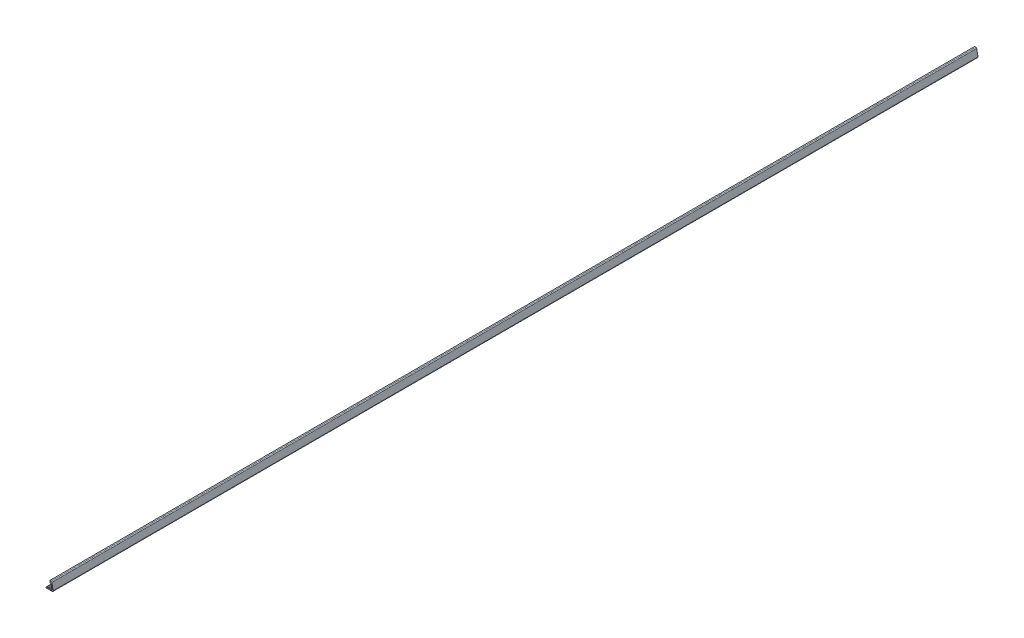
ISO-10303-21;
HEADER;
FILE_DESCRIPTION(('STEP AP214'),'2;1');
FILE_NAME('part.step','',(''),(''),'','','');
FILE_SCHEMA(('AUTOMOTIVE_DESIGN { 1 0 10303 214 1 1 1 1 }'));
ENDSEC;
DATA;
#1=APPLICATION_CONTEXT('core data for automotive mechanical design processes');
#2=APPLICATION_PROTOCOL_DEFINITION('international standard','automotive_design',2000,#1);
#3=PRODUCT_CONTEXT('',#1,'mechanical');
#4=PRODUCT('Part','Part','',(#3));
#5=PRODUCT_RELATED_PRODUCT_CATEGORY('part','',(#4));
#6=PRODUCT_DEFINITION_FORMATION('','',#4);
#7=PRODUCT_DEFINITION_CONTEXT('part definition',#1,'design');
#8=PRODUCT_DEFINITION('design','',#6,#7);
#9=PRODUCT_DEFINITION_SHAPE('','',#8);
#10=(LENGTH_UNIT() NAMED_UNIT(*) SI_UNIT(.MILLI.,.METRE.));
#11=(NAMED_UNIT(*) PLANE_ANGLE_UNIT() SI_UNIT($,.RADIAN.));
#12=(NAMED_UNIT(*) SI_UNIT($,.STERADIAN.) SOLID_ANGLE_UNIT());
#13=UNCERTAINTY_MEASURE_WITH_UNIT(LENGTH_MEASURE(1.E-05),#10,'distance_accuracy_value','');
#14=(GEOMETRIC_REPRESENTATION_CONTEXT(3) GLOBAL_UNCERTAINTY_ASSIGNED_CONTEXT((#13)) GLOBAL_UNIT_ASSIGNED_CONTEXT((#10,
#11,#12)) REPRESENTATION_CONTEXT('',''));
#15=CARTESIAN_POINT('',(0.,0.,0.));
#16=DIRECTION('',(0.,0.,1.));
#17=DIRECTION('',(1.,0.,0.));
#18=AXIS2_PLACEMENT_3D('',#15,#16,#17);
#19=CARTESIAN_POINT('',(3.10580902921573,1.,1000.));
#20=DIRECTION('',(0.,0.,-1.));
#21=DIRECTION('',(-1.,0.,0.));
#22=AXIS2_PLACEMENT_3D('',#19,#20,#21);
#23=CYLINDRICAL_SURFACE('',#22,1.);
#24=CARTESIAN_POINT('',(3.10580902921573,1.,0.));
#25=DIRECTION('',(0.,0.,1.));
#26=DIRECTION('',(1.,0.,0.));
#27=AXIS2_PLACEMENT_3D('',#24,#25,#26);
#28=CIRCLE('',#27,1.);
#29=CARTESIAN_POINT('',(3.10580902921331,0.,0.));
#30=VERTEX_POINT('',#29);
#31=CARTESIAN_POINT('',(4.08782513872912,1.18879714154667,0.));
#32=VERTEX_POINT('',#31);
#33=EDGE_CURVE('E227',#30,#32,#28,.T.);
#34=ORIENTED_EDGE('',*,*,#33,.T.);
#35=DIRECTION('',(0.,0.,-1.));
#36=VECTOR('',#35,1.);
#37=CARTESIAN_POINT('',(4.08782513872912,1.18879714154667,1000.));
#38=LINE('',#37,#36);
#39=CARTESIAN_POINT('',(4.08782513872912,1.18879714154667,1000.));
#40=VERTEX_POINT('',#39);
#41=EDGE_CURVE('E11',#40,#32,#38,.T.);
#42=ORIENTED_EDGE('',*,*,#41,.F.);
#43=CARTESIAN_POINT('',(3.10580902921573,1.,1000.));
#44=DIRECTION('',(0.,0.,1.));
#45=DIRECTION('',(1.,0.,0.));
#46=AXIS2_PLACEMENT_3D('',#43,#44,#45);
#47=CIRCLE('',#46,1.);
#48=CARTESIAN_POINT('',(3.10580902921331,0.,1000.));
#49=VERTEX_POINT('',#48);
#50=EDGE_CURVE('E273',#49,#40,#47,.T.);
#51=ORIENTED_EDGE('',*,*,#50,.F.);
#52=DIRECTION('',(0.,0.,-1.));
#53=VECTOR('',#52,1.);
#54=CARTESIAN_POINT('',(3.10580902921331,0.,1000.));
#55=LINE('',#54,#53);
#56=EDGE_CURVE('E223',#49,#30,#55,.T.);
#57=ORIENTED_EDGE('',*,*,#56,.T.);
#58=EDGE_LOOP('',(#34,#42,#51,#57));
#59=FACE_BOUND('',#58,.T.);
#60=ADVANCED_FACE('F35',(#59),#23,.T.);
#61=CARTESIAN_POINT('',(4.08782513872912,1.18879714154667,1000.));
#62=DIRECTION('',(-0.982016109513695,-0.188797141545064,0.));
#63=DIRECTION('',(0.188797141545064,-0.982016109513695,0.));
#64=AXIS2_PLACEMENT_3D('',#61,#62,#63);
#65=PLANE('',#64);
#66=DIRECTION('',(-0.188797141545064,0.982016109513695,0.));
#67=VECTOR('',#66,1.);
#68=CARTESIAN_POINT('',(4.08782513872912,1.18879714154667,0.));
#69=LINE('',#68,#67);
#70=CARTESIAN_POINT('',(2.7420427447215,8.18879714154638,0.));
#71=VERTEX_POINT('',#70);
#72=EDGE_CURVE('E230',#32,#71,#69,.T.);
#73=ORIENTED_EDGE('',*,*,#72,.T.);
#74=DIRECTION('',(0.,0.,-1.));
#75=VECTOR('',#74,1.);
#76=CARTESIAN_POINT('',(2.7420427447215,8.18879714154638,1000.));
#77=LINE('',#76,#75);
#78=CARTESIAN_POINT('',(2.7420427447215,8.18879714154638,1000.));
#79=VERTEX_POINT('',#78);
#80=EDGE_CURVE('E43',#79,#71,#77,.T.);
#81=ORIENTED_EDGE('',*,*,#80,.F.);
#82=DIRECTION('',(-0.188797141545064,0.982016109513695,0.));
#83=VECTOR('',#82,1.);
#84=CARTESIAN_POINT('',(4.08782513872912,1.18879714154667,1000.));
#85=LINE('',#84,#83);
#86=EDGE_CURVE('E142',#40,#79,#85,.T.);
#87=ORIENTED_EDGE('',*,*,#86,.F.);
#88=ORIENTED_EDGE('',*,*,#41,.T.);
#89=EDGE_LOOP('',(#73,#81,#87,#88));
#90=FACE_BOUND('',#89,.T.);
#91=ADVANCED_FACE('F411',(#90),#65,.F.);
#92=CARTESIAN_POINT('',(1.76002663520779,8.00000000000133,1000.));
#93=DIRECTION('',(0.,0.,-1.));
#94=DIRECTION('',(-1.,0.,0.));
#95=AXIS2_PLACEMENT_3D('',#92,#93,#94);
#96=CYLINDRICAL_SURFACE('',#95,1.00000000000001);
#97=CARTESIAN_POINT('',(1.76002663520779,8.00000000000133,0.));
#98=DIRECTION('',(0.,0.,1.));
#99=DIRECTION('',(1.,0.,0.));
#100=AXIS2_PLACEMENT_3D('',#97,#98,#99);
#101=CIRCLE('',#100,1.00000000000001);
#102=CARTESIAN_POINT('',(1.76002663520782,9.00000000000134,0.));
#103=VERTEX_POINT('',#102);
#104=EDGE_CURVE('E232',#71,#103,#101,.T.);
#105=ORIENTED_EDGE('',*,*,#104,.T.);
#106=DIRECTION('',(0.,0.,-1.));
#107=VECTOR('',#106,1.);
#108=CARTESIAN_POINT('',(1.76002663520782,9.00000000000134,1000.));
#109=LINE('',#108,#107);
#110=CARTESIAN_POINT('',(1.76002663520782,9.00000000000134,1000.));
#111=VERTEX_POINT('',#110);
#112=EDGE_CURVE('E328',#111,#103,#109,.T.);
#113=ORIENTED_EDGE('',*,*,#112,.F.);
#114=CARTESIAN_POINT('',(1.76002663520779,8.00000000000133,1000.));
#115=DIRECTION('',(0.,0.,1.));
#116=DIRECTION('',(1.,0.,0.));
#117=AXIS2_PLACEMENT_3D('',#114,#115,#116);
#118=CIRCLE('',#117,1.00000000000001);
#119=EDGE_CURVE('E336',#79,#111,#118,.T.);
#120=ORIENTED_EDGE('',*,*,#119,.F.);
#121=ORIENTED_EDGE('',*,*,#80,.T.);
#122=EDGE_LOOP('',(#105,#113,#120,#121));
#123=FACE_BOUND('',#122,.T.);
#124=ADVANCED_FACE('F334',(#123),#96,.T.);
#125=CARTESIAN_POINT('',(1.76002663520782,9.00000000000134,1000.));
#126=DIRECTION('',(0.,-1.,0.));
#127=DIRECTION('',(0.,0.,-1.));
#128=AXIS2_PLACEMENT_3D('',#125,#126,#127);
#129=PLANE('',#128);
#130=DIRECTION('',(-1.,0.,0.));
#131=VECTOR('',#130,1.);
#132=CARTESIAN_POINT('',(1.76002663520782,9.00000000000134,0.));
#133=LINE('',#132,#131);
#134=CARTESIAN_POINT('',(0.496296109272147,9.00000000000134,0.));
#135=VERTEX_POINT('',#134);
#136=EDGE_CURVE('E234',#103,#135,#133,.T.);
#137=ORIENTED_EDGE('',*,*,#136,.T.);
#138=DIRECTION('',(0.,0.,-1.));
#139=VECTOR('',#138,1.);
#140=CARTESIAN_POINT('',(0.496296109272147,9.00000000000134,1000.));
#141=LINE('',#140,#139);
#142=CARTESIAN_POINT('',(0.496296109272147,9.00000000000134,1000.));
#143=VERTEX_POINT('',#142);
#144=EDGE_CURVE('E325',#143,#135,#141,.T.);
#145=ORIENTED_EDGE('',*,*,#144,.F.);
#146=DIRECTION('',(-1.,0.,0.));
#147=VECTOR('',#146,1.);
#148=CARTESIAN_POINT('',(1.76002663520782,9.00000000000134,1000.));
#149=LINE('',#148,#147);
#150=EDGE_CURVE('E354',#111,#143,#149,.T.);
#151=ORIENTED_EDGE('',*,*,#150,.F.);
#152=ORIENTED_EDGE('',*,*,#112,.T.);
#153=EDGE_LOOP('',(#137,#145,#151,#152));
#154=FACE_BOUND('',#153,.T.);
#155=ADVANCED_FACE('F345',(#154),#129,.F.);
#156=CARTESIAN_POINT('',(0.496296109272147,9.00000000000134,1000.));
#157=DIRECTION('',(0.99654575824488,0.0830454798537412,0.));
#158=DIRECTION('',(-0.0830454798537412,0.99654575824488,0.));
#159=AXIS2_PLACEMENT_3D('',#156,#157,#158);
#160=PLANE('',#159);
#161=DIRECTION('',(0.0830454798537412,-0.99654575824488,0.));
#162=VECTOR('',#161,1.);
#163=CARTESIAN_POINT('',(0.496296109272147,9.00000000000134,0.));
#164=LINE('',#163,#162);
#165=CARTESIAN_POINT('',(0.696296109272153,6.6000000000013,0.));
#166=VERTEX_POINT('',#165);
#167=EDGE_CURVE('E236',#135,#166,#164,.T.);
#168=ORIENTED_EDGE('',*,*,#167,.T.);
#169=DIRECTION('',(0.,0.,-1.));
#170=VECTOR('',#169,1.);
#171=CARTESIAN_POINT('',(0.696296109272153,6.6000000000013,1000.));
#172=LINE('',#171,#170);
#173=CARTESIAN_POINT('',(0.696296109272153,6.6000000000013,1000.));
#174=VERTEX_POINT('',#173);
#175=EDGE_CURVE('E322',#174,#166,#172,.T.);
#176=ORIENTED_EDGE('',*,*,#175,.F.);
#177=DIRECTION('',(0.0830454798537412,-0.99654575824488,0.));
#178=VECTOR('',#177,1.);
#179=CARTESIAN_POINT('',(0.496296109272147,9.00000000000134,1000.));
#180=LINE('',#179,#178);
#181=EDGE_CURVE('E351',#143,#174,#180,.T.);
#182=ORIENTED_EDGE('',*,*,#181,.F.);
#183=ORIENTED_EDGE('',*,*,#144,.T.);
#184=EDGE_LOOP('',(#168,#176,#182,#183));
#185=FACE_BOUND('',#184,.T.);
#186=ADVANCED_FACE('F349',(#185),#160,.F.);
#187=CARTESIAN_POINT('',(1.42165172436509,6.6000000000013,1000.));
#188=DIRECTION('',(0.,1.,0.));
#189=DIRECTION('',(0.,0.,1.));
#190=AXIS2_PLACEMENT_3D('',#187,#188,#189);
#191=PLANE('',#190);
#192=DIRECTION('',(1.,0.,0.));
#193=VECTOR('',#192,1.);
#194=CARTESIAN_POINT('',(1.42165172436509,6.6000000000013,0.));
#195=LINE('',#194,#193);
#196=CARTESIAN_POINT('',(1.42165172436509,6.6000000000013,0.));
#197=VERTEX_POINT('',#196);
#198=EDGE_CURVE('E238',#166,#197,#195,.T.);
#199=ORIENTED_EDGE('',*,*,#198,.T.);
#200=DIRECTION('',(0.,0.,-1.));
#201=VECTOR('',#200,1.);
#202=CARTESIAN_POINT('',(1.42165172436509,6.6000000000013,1000.));
#203=LINE('',#202,#201);
#204=CARTESIAN_POINT('',(1.42165172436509,6.6000000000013,1000.));
#205=VERTEX_POINT('',#204);
#206=EDGE_CURVE('E319',#205,#197,#203,.T.);
#207=ORIENTED_EDGE('',*,*,#206,.F.);
#208=DIRECTION('',(1.,0.,0.));
#209=VECTOR('',#208,1.);
#210=CARTESIAN_POINT('',(1.42165172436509,6.6000000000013,1000.));
#211=LINE('',#210,#209);
#212=EDGE_CURVE('E353',#174,#205,#211,.T.);
#213=ORIENTED_EDGE('',*,*,#212,.F.);
#214=ORIENTED_EDGE('',*,*,#175,.T.);
#215=EDGE_LOOP('',(#199,#207,#213,#214));
#216=FACE_BOUND('',#215,.T.);
#217=ADVANCED_FACE('F424',(#216),#191,.F.);
#218=CARTESIAN_POINT('',(1.42165172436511,6.1000000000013,1000.));
#219=DIRECTION('',(0.,0.,-1.));
#220=DIRECTION('',(-1.,0.,0.));
#221=AXIS2_PLACEMENT_3D('',#218,#219,#220);
#222=CYLINDRICAL_SURFACE('',#221,0.5);
#223=CARTESIAN_POINT('',(1.42165172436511,6.1000000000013,0.));
#224=DIRECTION('',(0.,0.,-1.));
#225=DIRECTION('',(1.,0.,0.));
#226=AXIS2_PLACEMENT_3D('',#223,#224,#225);
#227=CIRCLE('',#226,0.5);
#228=CARTESIAN_POINT('',(1.90839460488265,6.21437380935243,0.));
#229=VERTEX_POINT('',#228);
#230=EDGE_CURVE('E240',#197,#229,#227,.T.);
#231=ORIENTED_EDGE('',*,*,#230,.T.);
#232=DIRECTION('',(0.,0.,-1.));
#233=VECTOR('',#232,1.);
#234=CARTESIAN_POINT('',(1.90839460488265,6.21437380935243,1000.));
#235=LINE('',#234,#233);
#236=CARTESIAN_POINT('',(1.90839460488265,6.21437380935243,1000.));
#237=VERTEX_POINT('',#236);
#238=EDGE_CURVE('E316',#237,#229,#235,.T.);
#239=ORIENTED_EDGE('',*,*,#238,.F.);
#240=CARTESIAN_POINT('',(1.42165172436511,6.1000000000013,1000.));
#241=DIRECTION('',(0.,0.,-1.));
#242=DIRECTION('',(1.,0.,0.));
#243=AXIS2_PLACEMENT_3D('',#240,#241,#242);
#244=CIRCLE('',#243,0.5);
#245=EDGE_CURVE('E356',#205,#237,#244,.T.);
#246=ORIENTED_EDGE('',*,*,#245,.F.);
#247=ORIENTED_EDGE('',*,*,#206,.T.);
#248=EDGE_LOOP('',(#231,#239,#246,#247));
#249=FACE_BOUND('',#248,.T.);
#250=ADVANCED_FACE('F427',(#249),#222,.F.);
#251=CARTESIAN_POINT('',(2.78956533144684,1.59366223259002,1000.));
#252=DIRECTION('',(0.982298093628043,0.187324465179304,0.));
#253=DIRECTION('',(-0.187324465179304,0.982298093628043,0.));
#254=AXIS2_PLACEMENT_3D('',#251,#252,#253);
#255=PLANE('',#254);
#256=DIRECTION('',(0.187324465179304,-0.982298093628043,0.));
#257=VECTOR('',#256,1.);
#258=CARTESIAN_POINT('',(2.78956533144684,1.59366223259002,0.));
#259=LINE('',#258,#257);
#260=CARTESIAN_POINT('',(2.78956533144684,1.59366223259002,0.));
#261=VERTEX_POINT('',#260);
#262=EDGE_CURVE('E242',#229,#261,#259,.T.);
#263=ORIENTED_EDGE('',*,*,#262,.T.);
#264=DIRECTION('',(0.,0.,-1.));
#265=VECTOR('',#264,1.);
#266=CARTESIAN_POINT('',(2.78956533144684,1.59366223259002,1000.));
#267=LINE('',#266,#265);
#268=CARTESIAN_POINT('',(2.78956533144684,1.59366223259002,1000.));
#269=VERTEX_POINT('',#268);
#270=EDGE_CURVE('E313',#269,#261,#267,.T.);
#271=ORIENTED_EDGE('',*,*,#270,.F.);
#272=DIRECTION('',(0.187324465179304,-0.982298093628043,0.));
#273=VECTOR('',#272,1.);
#274=CARTESIAN_POINT('',(2.78956533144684,1.59366223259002,1000.));
#275=LINE('',#274,#273);
#276=EDGE_CURVE('E362',#237,#269,#275,.T.);
#277=ORIENTED_EDGE('',*,*,#276,.F.);
#278=ORIENTED_EDGE('',*,*,#238,.T.);
#279=EDGE_LOOP('',(#263,#271,#277,#278));
#280=FACE_BOUND('',#279,.T.);
#281=ADVANCED_FACE('F431',(#280),#255,.F.);
#282=CARTESIAN_POINT('',(2.29841628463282,1.50000000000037,1000.));
#283=DIRECTION('',(0.,0.,-1.));
#284=DIRECTION('',(-1.,0.,0.));
#285=AXIS2_PLACEMENT_3D('',#282,#283,#284);
#286=CYLINDRICAL_SURFACE('',#285,0.499999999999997);
#287=CARTESIAN_POINT('',(2.29841628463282,1.50000000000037,0.));
#288=DIRECTION('',(0.,0.,-1.));
#289=DIRECTION('',(1.,0.,0.));
#290=AXIS2_PLACEMENT_3D('',#287,#288,#289);
#291=CIRCLE('',#290,0.499999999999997);
#292=CARTESIAN_POINT('',(2.29841628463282,1.00000000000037,0.));
#293=VERTEX_POINT('',#292);
#294=EDGE_CURVE('E244',#261,#293,#291,.T.);
#295=ORIENTED_EDGE('',*,*,#294,.T.);
#296=DIRECTION('',(0.,0.,-1.));
#297=VECTOR('',#296,1.);
#298=CARTESIAN_POINT('',(2.29841628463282,1.00000000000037,1000.));
#299=LINE('',#298,#297);
#300=CARTESIAN_POINT('',(2.29841628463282,1.00000000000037,1000.));
#301=VERTEX_POINT('',#300);
#302=EDGE_CURVE('E310',#301,#293,#299,.T.);
#303=ORIENTED_EDGE('',*,*,#302,.F.);
#304=CARTESIAN_POINT('',(2.29841628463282,1.50000000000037,1000.));
#305=DIRECTION('',(0.,0.,-1.));
#306=DIRECTION('',(1.,0.,0.));
#307=AXIS2_PLACEMENT_3D('',#304,#305,#306);
#308=CIRCLE('',#307,0.499999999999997);
#309=EDGE_CURVE('E364',#269,#301,#308,.T.);
#310=ORIENTED_EDGE('',*,*,#309,.F.);
#311=ORIENTED_EDGE('',*,*,#270,.T.);
#312=EDGE_LOOP('',(#295,#303,#310,#311));
#313=FACE_BOUND('',#312,.T.);
#314=ADVANCED_FACE('F435',(#313),#286,.F.);
#315=CARTESIAN_POINT('',(1.63857578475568,1.00000000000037,1000.));
#316=DIRECTION('',(0.,-1.,0.));
#317=DIRECTION('',(0.,0.,-1.));
#318=AXIS2_PLACEMENT_3D('',#315,#316,#317);
#319=PLANE('',#318);
#320=DIRECTION('',(-1.,0.,0.));
#321=VECTOR('',#320,1.);
#322=CARTESIAN_POINT('',(1.63857578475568,1.00000000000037,0.));
#323=LINE('',#322,#321);
#324=CARTESIAN_POINT('',(1.63857578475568,1.00000000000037,0.));
#325=VERTEX_POINT('',#324);
#326=EDGE_CURVE('E246',#293,#325,#323,.T.);
#327=ORIENTED_EDGE('',*,*,#326,.T.);
#328=DIRECTION('',(0.,0.,-1.));
#329=VECTOR('',#328,1.);
#330=CARTESIAN_POINT('',(1.63857578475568,1.00000000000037,1000.));
#331=LINE('',#330,#329);
#332=CARTESIAN_POINT('',(1.63857578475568,1.00000000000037,1000.));
#333=VERTEX_POINT('',#332);
#334=EDGE_CURVE('E307',#333,#325,#331,.T.);
#335=ORIENTED_EDGE('',*,*,#334,.F.);
#336=DIRECTION('',(-1.,0.,0.));
#337=VECTOR('',#336,1.);
#338=CARTESIAN_POINT('',(1.63857578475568,1.00000000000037,1000.));
#339=LINE('',#338,#337);
#340=EDGE_CURVE('E366',#301,#333,#339,.T.);
#341=ORIENTED_EDGE('',*,*,#340,.F.);
#342=ORIENTED_EDGE('',*,*,#302,.T.);
#343=EDGE_LOOP('',(#327,#335,#341,#342));
#344=FACE_BOUND('',#343,.T.);
#345=ADVANCED_FACE('F439',(#344),#319,.F.);
#346=CARTESIAN_POINT('',(1.43857578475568,1.80000000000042,1000.));
#347=DIRECTION('',(-0.970142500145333,-0.242535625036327,0.));
#348=DIRECTION('',(0.242535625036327,-0.970142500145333,0.));
#349=AXIS2_PLACEMENT_3D('',#346,#347,#348);
#350=PLANE('',#349);
#351=DIRECTION('',(-0.242535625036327,0.970142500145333,0.));
#352=VECTOR('',#351,1.);
#353=CARTESIAN_POINT('',(1.43857578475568,1.80000000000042,0.));
#354=LINE('',#353,#352);
#355=CARTESIAN_POINT('',(1.43857578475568,1.80000000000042,0.));
#356=VERTEX_POINT('',#355);
#357=EDGE_CURVE('E248',#325,#356,#354,.T.);
#358=ORIENTED_EDGE('',*,*,#357,.T.);
#359=DIRECTION('',(0.,0.,-1.));
#360=VECTOR('',#359,1.);
#361=CARTESIAN_POINT('',(1.43857578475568,1.80000000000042,1000.));
#362=LINE('',#361,#360);
#363=CARTESIAN_POINT('',(1.43857578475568,1.80000000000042,1000.));
#364=VERTEX_POINT('',#363);
#365=EDGE_CURVE('E304',#364,#356,#362,.T.);
#366=ORIENTED_EDGE('',*,*,#365,.F.);
#367=DIRECTION('',(-0.242535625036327,0.970142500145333,0.));
#368=VECTOR('',#367,1.);
#369=CARTESIAN_POINT('',(1.43857578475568,1.80000000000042,1000.));
#370=LINE('',#369,#368);
#371=EDGE_CURVE('E368',#333,#364,#370,.T.);
#372=ORIENTED_EDGE('',*,*,#371,.F.);
#373=ORIENTED_EDGE('',*,*,#334,.T.);
#374=EDGE_LOOP('',(#358,#366,#372,#373));
#375=FACE_BOUND('',#374,.T.);
#376=ADVANCED_FACE('F443',(#375),#350,.F.);
#377=CARTESIAN_POINT('',(1.43857578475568,1.80000000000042,1000.));
#378=DIRECTION('',(0.707106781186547,-0.707106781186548,0.));
#379=DIRECTION('',(0.707106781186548,0.707106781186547,0.));
#380=AXIS2_PLACEMENT_3D('',#377,#378,#379);
#381=PLANE('',#380);
#382=DIRECTION('',(-0.707106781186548,-0.707106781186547,0.));
#383=VECTOR('',#382,1.);
#384=CARTESIAN_POINT('',(1.43857578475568,1.80000000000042,0.));
#385=LINE('',#384,#383);
#386=CARTESIAN_POINT('',(0.638575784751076,0.999999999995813,0.));
#387=VERTEX_POINT('',#386);
#388=EDGE_CURVE('E250',#356,#387,#385,.T.);
#389=ORIENTED_EDGE('',*,*,#388,.T.);
#390=DIRECTION('',(0.,0.,-1.));
#391=VECTOR('',#390,1.);
#392=CARTESIAN_POINT('',(0.638575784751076,0.999999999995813,1000.));
#393=LINE('',#392,#391);
#394=CARTESIAN_POINT('',(0.638575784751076,0.999999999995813,1000.));
#395=VERTEX_POINT('',#394);
#396=EDGE_CURVE('E301',#395,#387,#393,.T.);
#397=ORIENTED_EDGE('',*,*,#396,.F.);
#398=DIRECTION('',(-0.707106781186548,-0.707106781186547,0.));
#399=VECTOR('',#398,1.);
#400=CARTESIAN_POINT('',(1.43857578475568,1.80000000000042,1000.));
#401=LINE('',#400,#399);
#402=EDGE_CURVE('E370',#364,#395,#401,.T.);
#403=ORIENTED_EDGE('',*,*,#402,.F.);
#404=ORIENTED_EDGE('',*,*,#365,.T.);
#405=EDGE_LOOP('',(#389,#397,#403,#404));
#406=FACE_BOUND('',#405,.T.);
#407=ADVANCED_FACE('F447',(#406),#381,.F.);
#408=CARTESIAN_POINT('',(0.438575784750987,1.79999999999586,1000.));
#409=DIRECTION('',(-0.97014250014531,-0.242535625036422,0.));
#410=DIRECTION('',(0.242535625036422,-0.97014250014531,0.));
#411=AXIS2_PLACEMENT_3D('',#408,#409,#410);
#412=PLANE('',#411);
#413=DIRECTION('',(-0.242535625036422,0.97014250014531,0.));
#414=VECTOR('',#413,1.);
#415=CARTESIAN_POINT('',(0.438575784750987,1.79999999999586,0.));
#416=LINE('',#415,#414);
#417=CARTESIAN_POINT('',(0.438575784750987,1.79999999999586,0.));
#418=VERTEX_POINT('',#417);
#419=EDGE_CURVE('E252',#387,#418,#416,.T.);
#420=ORIENTED_EDGE('',*,*,#419,.T.);
#421=DIRECTION('',(0.,0.,-1.));
#422=VECTOR('',#421,1.);
#423=CARTESIAN_POINT('',(0.438575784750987,1.79999999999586,1000.));
#424=LINE('',#423,#422);
#425=CARTESIAN_POINT('',(0.438575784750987,1.79999999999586,1000.));
#426=VERTEX_POINT('',#425);
#427=EDGE_CURVE('E298',#426,#418,#424,.T.);
#428=ORIENTED_EDGE('',*,*,#427,.F.);
#429=DIRECTION('',(-0.242535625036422,0.97014250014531,0.));
#430=VECTOR('',#429,1.);
#431=CARTESIAN_POINT('',(0.438575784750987,1.79999999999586,1000.));
#432=LINE('',#431,#430);
#433=EDGE_CURVE('E372',#395,#426,#432,.T.);
#434=ORIENTED_EDGE('',*,*,#433,.F.);
#435=ORIENTED_EDGE('',*,*,#396,.T.);
#436=EDGE_LOOP('',(#420,#428,#434,#435));
#437=FACE_BOUND('',#436,.T.);
#438=ADVANCED_FACE('F451',(#437),#412,.F.);
#439=CARTESIAN_POINT('',(0.438575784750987,1.79999999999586,1000.));
#440=DIRECTION('',(0.707106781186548,-0.707106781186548,0.));
#441=DIRECTION('',(0.707106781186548,0.707106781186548,0.));
#442=AXIS2_PLACEMENT_3D('',#439,#440,#441);
#443=PLANE('',#442);
#444=DIRECTION('',(-0.707106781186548,-0.707106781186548,0.));
#445=VECTOR('',#444,1.);
#446=CARTESIAN_POINT('',(0.438575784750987,1.79999999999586,0.));
#447=LINE('',#446,#445);
#448=CARTESIAN_POINT('',(-0.361424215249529,0.999999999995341,0.));
#449=VERTEX_POINT('',#448);
#450=EDGE_CURVE('E254',#418,#449,#447,.T.);
#451=ORIENTED_EDGE('',*,*,#450,.T.);
#452=DIRECTION('',(0.,0.,-1.));
#453=VECTOR('',#452,1.);
#454=CARTESIAN_POINT('',(-0.361424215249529,0.999999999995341,1000.));
#455=LINE('',#454,#453);
#456=CARTESIAN_POINT('',(-0.361424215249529,0.999999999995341,1000.));
#457=VERTEX_POINT('',#456);
#458=EDGE_CURVE('E295',#457,#449,#455,.T.);
#459=ORIENTED_EDGE('',*,*,#458,.F.);
#460=DIRECTION('',(-0.707106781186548,-0.707106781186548,0.));
#461=VECTOR('',#460,1.);
#462=CARTESIAN_POINT('',(0.438575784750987,1.79999999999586,1000.));
#463=LINE('',#462,#461);
#464=EDGE_CURVE('E374',#426,#457,#463,.T.);
#465=ORIENTED_EDGE('',*,*,#464,.F.);
#466=ORIENTED_EDGE('',*,*,#427,.T.);
#467=EDGE_LOOP('',(#451,#459,#465,#466));
#468=FACE_BOUND('',#467,.T.);
#469=ADVANCED_FACE('F455',(#468),#443,.F.);
#470=CARTESIAN_POINT('',(-0.561424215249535,1.79999999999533,1000.));
#471=DIRECTION('',(-0.970142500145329,-0.242535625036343,0.));
#472=DIRECTION('',(0.242535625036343,-0.970142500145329,0.));
#473=AXIS2_PLACEMENT_3D('',#470,#471,#472);
#474=PLANE('',#473);
#475=DIRECTION('',(-0.242535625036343,0.970142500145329,0.));
#476=VECTOR('',#475,1.);
#477=CARTESIAN_POINT('',(-0.561424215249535,1.79999999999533,0.));
#478=LINE('',#477,#476);
#479=CARTESIAN_POINT('',(-0.561424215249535,1.79999999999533,0.));
#480=VERTEX_POINT('',#479);
#481=EDGE_CURVE('E256',#449,#480,#478,.T.);
#482=ORIENTED_EDGE('',*,*,#481,.T.);
#483=DIRECTION('',(0.,0.,-1.));
#484=VECTOR('',#483,1.);
#485=CARTESIAN_POINT('',(-0.561424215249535,1.79999999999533,1000.));
#486=LINE('',#485,#484);
#487=CARTESIAN_POINT('',(-0.561424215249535,1.79999999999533,1000.));
#488=VERTEX_POINT('',#487);
#489=EDGE_CURVE('E292',#488,#480,#486,.T.);
#490=ORIENTED_EDGE('',*,*,#489,.F.);
#491=DIRECTION('',(-0.242535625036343,0.970142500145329,0.));
#492=VECTOR('',#491,1.);
#493=CARTESIAN_POINT('',(-0.561424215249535,1.79999999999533,1000.));
#494=LINE('',#493,#492);
#495=EDGE_CURVE('E376',#457,#488,#494,.T.);
#496=ORIENTED_EDGE('',*,*,#495,.F.);
#497=ORIENTED_EDGE('',*,*,#458,.T.);
#498=EDGE_LOOP('',(#482,#490,#496,#497));
#499=FACE_BOUND('',#498,.T.);
#500=ADVANCED_FACE('F459',(#499),#474,.F.);
#501=CARTESIAN_POINT('',(-0.561424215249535,1.79999999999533,1000.));
#502=DIRECTION('',(0.707106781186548,-0.707106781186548,0.));
#503=DIRECTION('',(0.707106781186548,0.707106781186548,0.));
#504=AXIS2_PLACEMENT_3D('',#501,#502,#503);
#505=PLANE('',#504);
#506=DIRECTION('',(-0.707106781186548,-0.707106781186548,0.));
#507=VECTOR('',#506,1.);
#508=CARTESIAN_POINT('',(-0.561424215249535,1.79999999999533,0.));
#509=LINE('',#508,#507);
#510=CARTESIAN_POINT('',(-1.36142421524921,0.999999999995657,0.));
#511=VERTEX_POINT('',#510);
#512=EDGE_CURVE('E258',#480,#511,#509,.T.);
#513=ORIENTED_EDGE('',*,*,#512,.T.);
#514=DIRECTION('',(0.,0.,-1.));
#515=VECTOR('',#514,1.);
#516=CARTESIAN_POINT('',(-1.36142421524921,0.999999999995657,1000.));
#517=LINE('',#516,#515);
#518=CARTESIAN_POINT('',(-1.36142421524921,0.999999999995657,1000.));
#519=VERTEX_POINT('',#518);
#520=EDGE_CURVE('E289',#519,#511,#517,.T.);
#521=ORIENTED_EDGE('',*,*,#520,.F.);
#522=DIRECTION('',(-0.707106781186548,-0.707106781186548,0.));
#523=VECTOR('',#522,1.);
#524=CARTESIAN_POINT('',(-0.561424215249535,1.79999999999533,1000.));
#525=LINE('',#524,#523);
#526=EDGE_CURVE('E378',#488,#519,#525,.T.);
#527=ORIENTED_EDGE('',*,*,#526,.F.);
#528=ORIENTED_EDGE('',*,*,#489,.T.);
#529=EDGE_LOOP('',(#513,#521,#527,#528));
#530=FACE_BOUND('',#529,.T.);
#531=ADVANCED_FACE('F463',(#530),#505,.F.);
#532=CARTESIAN_POINT('',(-1.56142421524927,1.79999999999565,1000.));
#533=DIRECTION('',(-0.970142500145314,-0.242535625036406,0.));
#534=DIRECTION('',(0.242535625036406,-0.970142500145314,0.));
#535=AXIS2_PLACEMENT_3D('',#532,#533,#534);
#536=PLANE('',#535);
#537=DIRECTION('',(-0.242535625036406,0.970142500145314,0.));
#538=VECTOR('',#537,1.);
#539=CARTESIAN_POINT('',(-1.56142421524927,1.79999999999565,0.));
#540=LINE('',#539,#538);
#541=CARTESIAN_POINT('',(-1.56142421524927,1.79999999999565,0.));
#542=VERTEX_POINT('',#541);
#543=EDGE_CURVE('E260',#511,#542,#540,.T.);
#544=ORIENTED_EDGE('',*,*,#543,.T.);
#545=DIRECTION('',(0.,0.,-1.));
#546=VECTOR('',#545,1.);
#547=CARTESIAN_POINT('',(-1.56142421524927,1.79999999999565,1000.));
#548=LINE('',#547,#546);
#549=CARTESIAN_POINT('',(-1.56142421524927,1.79999999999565,1000.));
#550=VERTEX_POINT('',#549);
#551=EDGE_CURVE('E286',#550,#542,#548,.T.);
#552=ORIENTED_EDGE('',*,*,#551,.F.);
#553=DIRECTION('',(-0.242535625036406,0.970142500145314,0.));
#554=VECTOR('',#553,1.);
#555=CARTESIAN_POINT('',(-1.56142421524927,1.79999999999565,1000.));
#556=LINE('',#555,#554);
#557=EDGE_CURVE('E380',#519,#550,#556,.T.);
#558=ORIENTED_EDGE('',*,*,#557,.F.);
#559=ORIENTED_EDGE('',*,*,#520,.T.);
#560=EDGE_LOOP('',(#544,#552,#558,#559));
#561=FACE_BOUND('',#560,.T.);
#562=ADVANCED_FACE('F467',(#561),#536,.F.);
#563=CARTESIAN_POINT('',(-1.56142421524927,1.79999999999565,1000.));
#564=DIRECTION('',(0.707106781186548,-0.707106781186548,0.));
#565=DIRECTION('',(0.707106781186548,0.707106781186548,0.));
#566=AXIS2_PLACEMENT_3D('',#563,#564,#565);
#567=PLANE('',#566);
#568=DIRECTION('',(-0.707106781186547,-0.707106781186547,0.));
#569=VECTOR('',#568,1.);
#570=CARTESIAN_POINT('',(-1.56142421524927,1.79999999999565,0.));
#571=LINE('',#570,#569);
#572=CARTESIAN_POINT('',(-2.36142421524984,0.999999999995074,0.));
#573=VERTEX_POINT('',#572);
#574=EDGE_CURVE('E262',#542,#573,#571,.T.);
#575=ORIENTED_EDGE('',*,*,#574,.T.);
#576=DIRECTION('',(0.,0.,-1.));
#577=VECTOR('',#576,1.);
#578=CARTESIAN_POINT('',(-2.36142421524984,0.999999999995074,1000.));
#579=LINE('',#578,#577);
#580=CARTESIAN_POINT('',(-2.36142421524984,0.999999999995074,1000.));
#581=VERTEX_POINT('',#580);
#582=EDGE_CURVE('E283',#581,#573,#579,.T.);
#583=ORIENTED_EDGE('',*,*,#582,.F.);
#584=DIRECTION('',(-0.707106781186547,-0.707106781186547,0.));
#585=VECTOR('',#584,1.);
#586=CARTESIAN_POINT('',(-1.56142421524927,1.79999999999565,1000.));
#587=LINE('',#586,#585);
#588=EDGE_CURVE('E382',#550,#581,#587,.T.);
#589=ORIENTED_EDGE('',*,*,#588,.F.);
#590=ORIENTED_EDGE('',*,*,#551,.T.);
#591=EDGE_LOOP('',(#575,#583,#589,#590));
#592=FACE_BOUND('',#591,.T.);
#593=ADVANCED_FACE('F471',(#592),#567,.F.);
#594=CARTESIAN_POINT('',(-2.56142421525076,1.79999999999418,1000.));
#595=DIRECTION('',(-0.970142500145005,-0.24253562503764,0.));
#596=DIRECTION('',(0.24253562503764,-0.970142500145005,0.));
#597=AXIS2_PLACEMENT_3D('',#594,#595,#596);
#598=PLANE('',#597);
#599=DIRECTION('',(-0.24253562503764,0.970142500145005,0.));
#600=VECTOR('',#599,1.);
#601=CARTESIAN_POINT('',(-2.56142421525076,1.79999999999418,0.));
#602=LINE('',#601,#600);
#603=CARTESIAN_POINT('',(-2.56142421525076,1.79999999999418,0.));
#604=VERTEX_POINT('',#603);
#605=EDGE_CURVE('E264',#573,#604,#602,.T.);
#606=ORIENTED_EDGE('',*,*,#605,.T.);
#607=DIRECTION('',(0.,0.,-1.));
#608=VECTOR('',#607,1.);
#609=CARTESIAN_POINT('',(-2.56142421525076,1.79999999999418,1000.));
#610=LINE('',#609,#608);
#611=CARTESIAN_POINT('',(-2.56142421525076,1.79999999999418,1000.));
#612=VERTEX_POINT('',#611);
#613=EDGE_CURVE('E280',#612,#604,#610,.T.);
#614=ORIENTED_EDGE('',*,*,#613,.F.);
#615=DIRECTION('',(-0.24253562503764,0.970142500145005,0.));
#616=VECTOR('',#615,1.);
#617=CARTESIAN_POINT('',(-2.56142421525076,1.79999999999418,1000.));
#618=LINE('',#617,#616);
#619=EDGE_CURVE('E384',#581,#612,#618,.T.);
#620=ORIENTED_EDGE('',*,*,#619,.F.);
#621=ORIENTED_EDGE('',*,*,#582,.T.);
#622=EDGE_LOOP('',(#606,#614,#620,#621));
#623=FACE_BOUND('',#622,.T.);
#624=ADVANCED_FACE('F475',(#623),#598,.F.);
#625=CARTESIAN_POINT('',(-2.56142421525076,1.79999999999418,1000.));
#626=DIRECTION('',(0.707106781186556,-0.707106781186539,0.));
#627=DIRECTION('',(0.707106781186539,0.707106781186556,0.));
#628=AXIS2_PLACEMENT_3D('',#625,#626,#627);
#629=PLANE('',#628);
#630=DIRECTION('',(-0.707106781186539,-0.707106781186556,0.));
#631=VECTOR('',#630,1.);
#632=CARTESIAN_POINT('',(-2.56142421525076,1.79999999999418,0.));
#633=LINE('',#632,#631);
#634=CARTESIAN_POINT('',(-3.45936241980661,0.902061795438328,0.));
#635=VERTEX_POINT('',#634);
#636=EDGE_CURVE('E266',#604,#635,#633,.T.);
#637=ORIENTED_EDGE('',*,*,#636,.T.);
#638=DIRECTION('',(0.,0.,-1.));
#639=VECTOR('',#638,1.);
#640=CARTESIAN_POINT('',(-3.45936241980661,0.902061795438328,1000.));
#641=LINE('',#640,#639);
#642=CARTESIAN_POINT('',(-3.45936241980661,0.902061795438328,1000.));
#643=VERTEX_POINT('',#642);
#644=EDGE_CURVE('E277',#643,#635,#641,.T.);
#645=ORIENTED_EDGE('',*,*,#644,.F.);
#646=DIRECTION('',(-0.707106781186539,-0.707106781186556,0.));
#647=VECTOR('',#646,1.);
#648=CARTESIAN_POINT('',(-2.56142421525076,1.79999999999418,1000.));
#649=LINE('',#648,#647);
#650=EDGE_CURVE('E386',#612,#643,#649,.T.);
#651=ORIENTED_EDGE('',*,*,#650,.F.);
#652=ORIENTED_EDGE('',*,*,#613,.T.);
#653=EDGE_LOOP('',(#637,#645,#651,#652));
#654=FACE_BOUND('',#653,.T.);
#655=ADVANCED_FACE('F392',(#654),#629,.F.);
#656=CARTESIAN_POINT('',(-3.1058090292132,0.548508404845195,1000.));
#657=DIRECTION('',(0.,0.,-1.));
#658=DIRECTION('',(-1.,0.,0.));
#659=AXIS2_PLACEMENT_3D('',#656,#657,#658);
#660=CYLINDRICAL_SURFACE('',#659,0.499999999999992);
#661=CARTESIAN_POINT('',(-3.1058090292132,0.548508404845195,0.));
#662=DIRECTION('',(0.,0.,1.));
#663=DIRECTION('',(1.,0.,0.));
#664=AXIS2_PLACEMENT_3D('',#661,#662,#663);
#665=CIRCLE('',#664,0.499999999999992);
#666=CARTESIAN_POINT('',(-3.6058090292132,0.548508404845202,0.));
#667=VERTEX_POINT('',#666);
#668=EDGE_CURVE('E268',#635,#667,#665,.T.);
#669=ORIENTED_EDGE('',*,*,#668,.T.);
#670=DIRECTION('',(0.,0.,-1.));
#671=VECTOR('',#670,1.);
#672=CARTESIAN_POINT('',(-3.6058090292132,0.548508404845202,1000.));
#673=LINE('',#672,#671);
#674=CARTESIAN_POINT('',(-3.6058090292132,0.548508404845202,1000.));
#675=VERTEX_POINT('',#674);
#676=EDGE_CURVE('E218',#675,#667,#673,.T.);
#677=ORIENTED_EDGE('',*,*,#676,.F.);
#678=CARTESIAN_POINT('',(-3.1058090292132,0.548508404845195,1000.));
#679=DIRECTION('',(0.,0.,1.));
#680=DIRECTION('',(1.,0.,0.));
#681=AXIS2_PLACEMENT_3D('',#678,#679,#680);
#682=CIRCLE('',#681,0.499999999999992);
#683=EDGE_CURVE('E209',#643,#675,#682,.T.);
#684=ORIENTED_EDGE('',*,*,#683,.F.);
#685=ORIENTED_EDGE('',*,*,#644,.T.);
#686=EDGE_LOOP('',(#669,#677,#684,#685));
#687=FACE_BOUND('',#686,.T.);
#688=ADVANCED_FACE('F396',(#687),#660,.T.);
#689=CARTESIAN_POINT('',(-3.6058090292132,0.548508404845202,1000.));
#690=DIRECTION('',(1.,0.,0.));
#691=DIRECTION('',(0.,0.,-1.));
#692=AXIS2_PLACEMENT_3D('',#689,#690,#691);
#693=PLANE('',#692);
#694=DIRECTION('',(0.,-1.,0.));
#695=VECTOR('',#694,1.);
#696=CARTESIAN_POINT('',(-3.6058090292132,0.548508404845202,0.));
#697=LINE('',#696,#695);
#698=CARTESIAN_POINT('',(-3.6058090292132,0.500000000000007,0.));
#699=VERTEX_POINT('',#698);
#700=EDGE_CURVE('E217',#667,#699,#697,.T.);
#701=ORIENTED_EDGE('',*,*,#700,.T.);
#702=DIRECTION('',(0.,0.,-1.));
#703=VECTOR('',#702,1.);
#704=CARTESIAN_POINT('',(-3.6058090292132,0.500000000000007,1000.));
#705=LINE('',#704,#703);
#706=CARTESIAN_POINT('',(-3.6058090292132,0.500000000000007,1000.));
#707=VERTEX_POINT('',#706);
#708=EDGE_CURVE('E214',#707,#699,#705,.T.);
#709=ORIENTED_EDGE('',*,*,#708,.F.);
#710=DIRECTION('',(0.,-1.,0.));
#711=VECTOR('',#710,1.);
#712=CARTESIAN_POINT('',(-3.6058090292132,0.548508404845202,1000.));
#713=LINE('',#712,#711);
#714=EDGE_CURVE('E203',#675,#707,#713,.T.);
#715=ORIENTED_EDGE('',*,*,#714,.F.);
#716=ORIENTED_EDGE('',*,*,#676,.T.);
#717=EDGE_LOOP('',(#701,#709,#715,#716));
#718=FACE_BOUND('',#717,.T.);
#719=ADVANCED_FACE('F215',(#718),#693,.F.);
#720=CARTESIAN_POINT('',(-3.1058090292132,0.5,1000.));
#721=DIRECTION('',(0.,0.,-1.));
#722=DIRECTION('',(-1.,0.,0.));
#723=AXIS2_PLACEMENT_3D('',#720,#721,#722);
#724=CYLINDRICAL_SURFACE('',#723,0.5);
#725=CARTESIAN_POINT('',(-3.1058090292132,0.5,0.));
#726=DIRECTION('',(0.,0.,1.));
#727=DIRECTION('',(1.,0.,0.));
#728=AXIS2_PLACEMENT_3D('',#725,#726,#727);
#729=CIRCLE('',#728,0.5);
#730=CARTESIAN_POINT('',(-3.10580902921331,0.,0.));
#731=VERTEX_POINT('',#730);
#732=EDGE_CURVE('E128',#699,#731,#729,.T.);
#733=ORIENTED_EDGE('',*,*,#732,.T.);
#734=DIRECTION('',(0.,0.,-1.));
#735=VECTOR('',#734,1.);
#736=CARTESIAN_POINT('',(-3.10580902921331,0.,1000.));
#737=LINE('',#736,#735);
#738=CARTESIAN_POINT('',(-3.10580902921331,0.,1000.));
#739=VERTEX_POINT('',#738);
#740=EDGE_CURVE('E219',#739,#731,#737,.T.);
#741=ORIENTED_EDGE('',*,*,#740,.F.);
#742=CARTESIAN_POINT('',(-3.1058090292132,0.5,1000.));
#743=DIRECTION('',(0.,0.,1.));
#744=DIRECTION('',(1.,0.,0.));
#745=AXIS2_PLACEMENT_3D('',#742,#743,#744);
#746=CIRCLE('',#745,0.5);
#747=EDGE_CURVE('E207',#707,#739,#746,.T.);
#748=ORIENTED_EDGE('',*,*,#747,.F.);
#749=ORIENTED_EDGE('',*,*,#708,.T.);
#750=EDGE_LOOP('',(#733,#741,#748,#749));
#751=FACE_BOUND('',#750,.T.);
#752=ADVANCED_FACE('F221',(#751),#724,.T.);
#753=CARTESIAN_POINT('',(3.10580902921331,0.,1000.));
#754=DIRECTION('',(0.,1.,0.));
#755=DIRECTION('',(0.,0.,1.));
#756=AXIS2_PLACEMENT_3D('',#753,#754,#755);
#757=PLANE('',#756);
#758=DIRECTION('',(1.,0.,0.));
#759=VECTOR('',#758,1.);
#760=CARTESIAN_POINT('',(3.10580902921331,0.,0.));
#761=LINE('',#760,#759);
#762=EDGE_CURVE('E134',#731,#30,#761,.T.);
#763=ORIENTED_EDGE('',*,*,#762,.T.);
#764=ORIENTED_EDGE('',*,*,#56,.F.);
#765=DIRECTION('',(1.,0.,0.));
#766=VECTOR('',#765,1.);
#767=CARTESIAN_POINT('',(3.10580902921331,0.,1000.));
#768=LINE('',#767,#766);
#769=EDGE_CURVE('E51',#739,#49,#768,.T.);
#770=ORIENTED_EDGE('',*,*,#769,.F.);
#771=ORIENTED_EDGE('',*,*,#740,.T.);
#772=EDGE_LOOP('',(#763,#764,#770,#771));
#773=FACE_BOUND('',#772,.T.);
#774=ADVANCED_FACE('F400',(#773),#757,.F.);
#775=CARTESIAN_POINT('',(3.10580902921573,1.,1000.));
#776=DIRECTION('',(0.,0.,1.));
#777=DIRECTION('',(1.,0.,0.));
#778=AXIS2_PLACEMENT_3D('',#775,#776,#777);
#779=PLANE('',#778);
#780=ORIENTED_EDGE('',*,*,#50,.T.);
#781=ORIENTED_EDGE('',*,*,#86,.T.);
#782=ORIENTED_EDGE('',*,*,#119,.T.);
#783=ORIENTED_EDGE('',*,*,#150,.T.);
#784=ORIENTED_EDGE('',*,*,#181,.T.);
#785=ORIENTED_EDGE('',*,*,#212,.T.);
#786=ORIENTED_EDGE('',*,*,#245,.T.);
#787=ORIENTED_EDGE('',*,*,#276,.T.);
#788=ORIENTED_EDGE('',*,*,#309,.T.);
#789=ORIENTED_EDGE('',*,*,#340,.T.);
#790=ORIENTED_EDGE('',*,*,#371,.T.);
#791=ORIENTED_EDGE('',*,*,#402,.T.);
#792=ORIENTED_EDGE('',*,*,#433,.T.);
#793=ORIENTED_EDGE('',*,*,#464,.T.);
#794=ORIENTED_EDGE('',*,*,#495,.T.);
#795=ORIENTED_EDGE('',*,*,#526,.T.);
#796=ORIENTED_EDGE('',*,*,#557,.T.);
#797=ORIENTED_EDGE('',*,*,#588,.T.);
#798=ORIENTED_EDGE('',*,*,#619,.T.);
#799=ORIENTED_EDGE('',*,*,#650,.T.);
#800=ORIENTED_EDGE('',*,*,#683,.T.);
#801=ORIENTED_EDGE('',*,*,#714,.T.);
#802=ORIENTED_EDGE('',*,*,#747,.T.);
#803=ORIENTED_EDGE('',*,*,#769,.T.);
#804=EDGE_LOOP('',(#780,#781,#782,#783,#784,#785,#786,#787,#788,#789,#790,#791,#792,#793,#794,
#795,#796,#797,#798,#799,#800,#801,#802,#803));
#805=FACE_BOUND('',#804,.T.);
#806=ADVANCED_FACE('F205',(#805),#779,.T.);
#807=CARTESIAN_POINT('',(3.10580902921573,1.,0.));
#808=DIRECTION('',(0.,0.,1.));
#809=DIRECTION('',(1.,0.,0.));
#810=AXIS2_PLACEMENT_3D('',#807,#808,#809);
#811=PLANE('',#810);
#812=ORIENTED_EDGE('',*,*,#33,.F.);
#813=ORIENTED_EDGE('',*,*,#762,.F.);
#814=ORIENTED_EDGE('',*,*,#732,.F.);
#815=ORIENTED_EDGE('',*,*,#700,.F.);
#816=ORIENTED_EDGE('',*,*,#668,.F.);
#817=ORIENTED_EDGE('',*,*,#636,.F.);
#818=ORIENTED_EDGE('',*,*,#605,.F.);
#819=ORIENTED_EDGE('',*,*,#574,.F.);
#820=ORIENTED_EDGE('',*,*,#543,.F.);
#821=ORIENTED_EDGE('',*,*,#512,.F.);
#822=ORIENTED_EDGE('',*,*,#481,.F.);
#823=ORIENTED_EDGE('',*,*,#450,.F.);
#824=ORIENTED_EDGE('',*,*,#419,.F.);
#825=ORIENTED_EDGE('',*,*,#388,.F.);
#826=ORIENTED_EDGE('',*,*,#357,.F.);
#827=ORIENTED_EDGE('',*,*,#326,.F.);
#828=ORIENTED_EDGE('',*,*,#294,.F.);
#829=ORIENTED_EDGE('',*,*,#262,.F.);
#830=ORIENTED_EDGE('',*,*,#230,.F.);
#831=ORIENTED_EDGE('',*,*,#198,.F.);
#832=ORIENTED_EDGE('',*,*,#167,.F.);
#833=ORIENTED_EDGE('',*,*,#136,.F.);
#834=ORIENTED_EDGE('',*,*,#104,.F.);
#835=ORIENTED_EDGE('',*,*,#72,.F.);
#836=EDGE_LOOP('',(#812,#813,#814,#815,#816,#817,#818,#819,#820,#821,#822,#823,#824,#825,#826,
#827,#828,#829,#830,#831,#832,#833,#834,#835));
#837=FACE_BOUND('',#836,.T.);
#838=ADVANCED_FACE('F340',(#837),#811,.F.);
#839=CLOSED_SHELL('',(#60,#91,#124,#155,#186,#217,#250,#281,#314,#345,#376,#407,#438,#469,#500,
#531,#562,#593,#624,#655,#688,#719,#752,#774,#806,#838));
#840=MANIFOLD_SOLID_BREP('B2',#839);
#841=ADVANCED_BREP_SHAPE_REPRESENTATION('',(#18,#840),#14);
#842=SHAPE_DEFINITION_REPRESENTATION(#9,#841);
ENDSEC;
END-ISO-10303-21;
